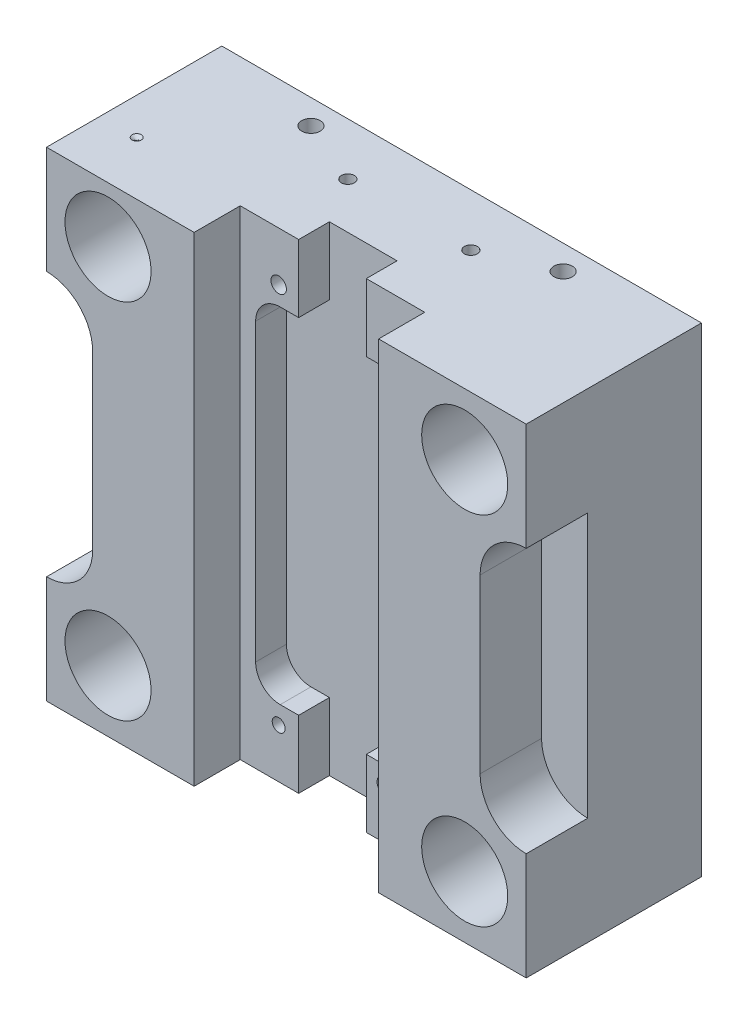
from build123d import *

# Parameters (mm, degrees)
ESQUISSE1_W                       = 156
ESQUISSE1_H                       = 156
ESQUISSE1_R                       = 14
EXTRUSION1_DEPTH                  = 57
ESQUISSE2_W                       = 60
ESQUISSE2_H                       = 160
ENL_V_MAT_EXTRU_1_DEPTH           = 15
ENL_V_MAT_EXTRU_2_DEPTH           = 20
ENL_V_MAT_EXTRU_3_DEPTH           = 20
ESQUISSE5_R                       = 3.0035
ESQUISSE5_R_2                     = 2.5035
ENL_V_MAT_EXTRU_4_DEPTH           = 125.165212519
TROU_TARAUD_M5X0_81_D             = 4.2
TROU_TARAUD_M5X0_81_DEPTH         = 12.4
TROU_TARAUD_M5X0_81_TIP           = 1.2618073
ENL_V_MAT_EXTRU_5_DEPTH           = 10
DIAM_TRE_DU_PER_AGE_3_0_3_1_D     = 3
DIAM_TRE_DU_PER_AGE_3_0_3_1_DEPTH = 0.001
DIAM_TRE_DU_PER_AGE_3_0_3_1_TIP   = 0.901290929
ESQUISSE11_R                      = 3.004
ENL_V_MAT_EXTRU_6_DEPTH           = 15
TROU_TARAUD_M5X0_82_D             = 4.2
TROU_TARAUD_M5X0_82_DEPTH         = 12.4
TROU_TARAUD_M5X0_82_TIP           = 1.2618073


with BuildPart() as part:
    # Esquisse1 → Extrusion1 (new body)
    with BuildSketch(Plane.XY):
        Rectangle(ESQUISSE1_W, ESQUISSE1_H)
        with Locations(Location((58, 58, 0), (0, 0, 180))):
            Circle(ESQUISSE1_R, mode=Mode.SUBTRACT)
        with Locations(Location((58, -58, 0), (0, 0, 180))):
            Circle(ESQUISSE1_R, mode=Mode.SUBTRACT)
        with Locations(Location((-58, -58, 0), (0, 0, 180))):
            Circle(ESQUISSE1_R, mode=Mode.SUBTRACT)
        with Locations(Location((-58, 60, 0), (0, 0, 180))):
            Circle(ESQUISSE1_R, mode=Mode.SUBTRACT)
    extrude(amount=EXTRUSION1_DEPTH)

    # Esquisse2 → Enl_v. mat.-Extru.1 (cut)
    with BuildSketch(Plane.XY.offset(57)):
        Rectangle(ESQUISSE2_W, ESQUISSE2_H)
    extrude(amount=-ENL_V_MAT_EXTRU_1_DEPTH, mode=Mode.SUBTRACT)

    # Esquisse3 → Enl_v. mat.-Extru.2 (cut)
    with BuildSketch(Plane.XY.offset(57)):
        with BuildLine():
            Line((-63, -28), (-63, 28))
            ThreePointArc((-63, 28), (-67.393398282, 38.606601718), (-78, 43))
            Line((-78, 43), (-78, -43))
            ThreePointArc((-78, -43), (-67.393398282, -38.606601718), (-63, -28))
        make_face()
    extrude(amount=-ENL_V_MAT_EXTRU_2_DEPTH, mode=Mode.SUBTRACT)

    # Esquisse4 → Enl_v. mat.-Extru.3 (cut)
    with BuildSketch(Plane.XY.offset(57)):
        with BuildLine():
            Line((78, -43), (78, 43))
            ThreePointArc((78, 43), (67.393398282, 38.606601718), (63, 28))
            Line((63, 28), (63, -28))
            ThreePointArc((63, -28), (67.393398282, -38.606601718), (78, -43))
        make_face()
    extrude(amount=-ENL_V_MAT_EXTRU_3_DEPTH, mode=Mode.SUBTRACT)

    # Esquisse5 → Enl_v. mat.-Extru.4 (cut, through all)
    with BuildSketch(Plane(origin=(0, 0, 0), x_dir=(-1, 0, 0), z_dir=(0, 0, -1))):
        with Locations((-17.5, -62)):
            Circle(ESQUISSE5_R)
        with Locations((17.5, 62)):
            Circle(ESQUISSE5_R_2)
    extrude(amount=-ENL_V_MAT_EXTRU_4_DEPTH, mode=Mode.SUBTRACT)

    # Trou taraud_ M5x0.81
    with Locations(Plane(origin=(-17.5, -62, 42), x_dir=(1, 0, 0), z_dir=(0, 0, 1))):
        with Locations((0, 0), (35, 124)):
            Hole(TROU_TARAUD_M5X0_81_D / 2, depth=TROU_TARAUD_M5X0_81_DEPTH)
            with Locations((0, 0, -(TROU_TARAUD_M5X0_81_DEPTH + TROU_TARAUD_M5X0_81_TIP / 2))):  # 118° drill point
                Cone(0, TROU_TARAUD_M5X0_81_D / 2, TROU_TARAUD_M5X0_81_TIP, mode=Mode.SUBTRACT)

    # Esquisse8 → Enl_v. mat.-Extru.5 (cut)
    with BuildSketch(Plane.XY.offset(42)):
        with BuildLine():
            Line((-17, -56), (-11, -56))
            Line((-11, -56), (-11, -78))
            Line((-11, -78), (11, -78))
            Line((11, -78), (11, -56))
            Line((11, -56), (17, -56))
            ThreePointArc((17, -56), (22.656854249, -53.656854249), (25, -48))
            Line((25, -48), (25, 48))
            ThreePointArc((25, 48), (22.656854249, 53.656854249), (17, 56))
            Line((17, 56), (11, 56))
            Line((11, 56), (11, 78))
            Line((11, 78), (-11, 78))
            Line((-11, 78), (-11, 56))
            Line((-11, 56), (-17, 56))
            ThreePointArc((-17, 56), (-22.656854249, 53.656854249), (-25, 48))
            Line((-25, 48), (-25, -48))
            ThreePointArc((-25, -48), (-22.656854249, -53.656854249), (-17, -56))
        make_face()
    extrude(amount=-ENL_V_MAT_EXTRU_5_DEPTH, mode=Mode.SUBTRACT)

    # Diam_tre du per_age _3.0 _3_1
    with Locations(Plane(origin=(0, 78, 0), x_dir=(-1, 0, 0), z_dir=(0, 1, 0))):
        with Locations((66.102330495, 39.571928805)):
            Hole(DIAM_TRE_DU_PER_AGE_3_0_3_1_D / 2, depth=DIAM_TRE_DU_PER_AGE_3_0_3_1_DEPTH)
            with Locations((0, 0, -(DIAM_TRE_DU_PER_AGE_3_0_3_1_DEPTH + DIAM_TRE_DU_PER_AGE_3_0_3_1_TIP / 2))):  # 118° drill point
                Cone(0, DIAM_TRE_DU_PER_AGE_3_0_3_1_D / 2, DIAM_TRE_DU_PER_AGE_3_0_3_1_TIP, mode=Mode.SUBTRACT)

    # Esquisse11 → Enl_v. mat.-Extru.6 (cut)
    with BuildSketch(Plane(origin=(0, 78, 0), x_dir=(-1, 0, 0), z_dir=(0, 1, 0))):
        with Locations(Location((41, 8, 0), (0, 0, 90))):
            Circle(ESQUISSE11_R)
        with Locations(Location((-41, 8, 0), (0, 0, 90))):
            Circle(ESQUISSE11_R)
    extrude(amount=-ENL_V_MAT_EXTRU_6_DEPTH, mode=Mode.SUBTRACT)

    # Trou taraud_ M5x0.82
    with Locations(Plane(origin=(0, 78, 0), x_dir=(-1, 0, 0), z_dir=(0, 1, 0))):
        with Locations((20, 17), (-20, 17)):
            Hole(TROU_TARAUD_M5X0_82_D / 2, depth=TROU_TARAUD_M5X0_82_DEPTH)
            with Locations((0, 0, -(TROU_TARAUD_M5X0_82_DEPTH + TROU_TARAUD_M5X0_82_TIP / 2))):  # 118° drill point
                Cone(0, TROU_TARAUD_M5X0_82_D / 2, TROU_TARAUD_M5X0_82_TIP, mode=Mode.SUBTRACT)


solid = part.part
